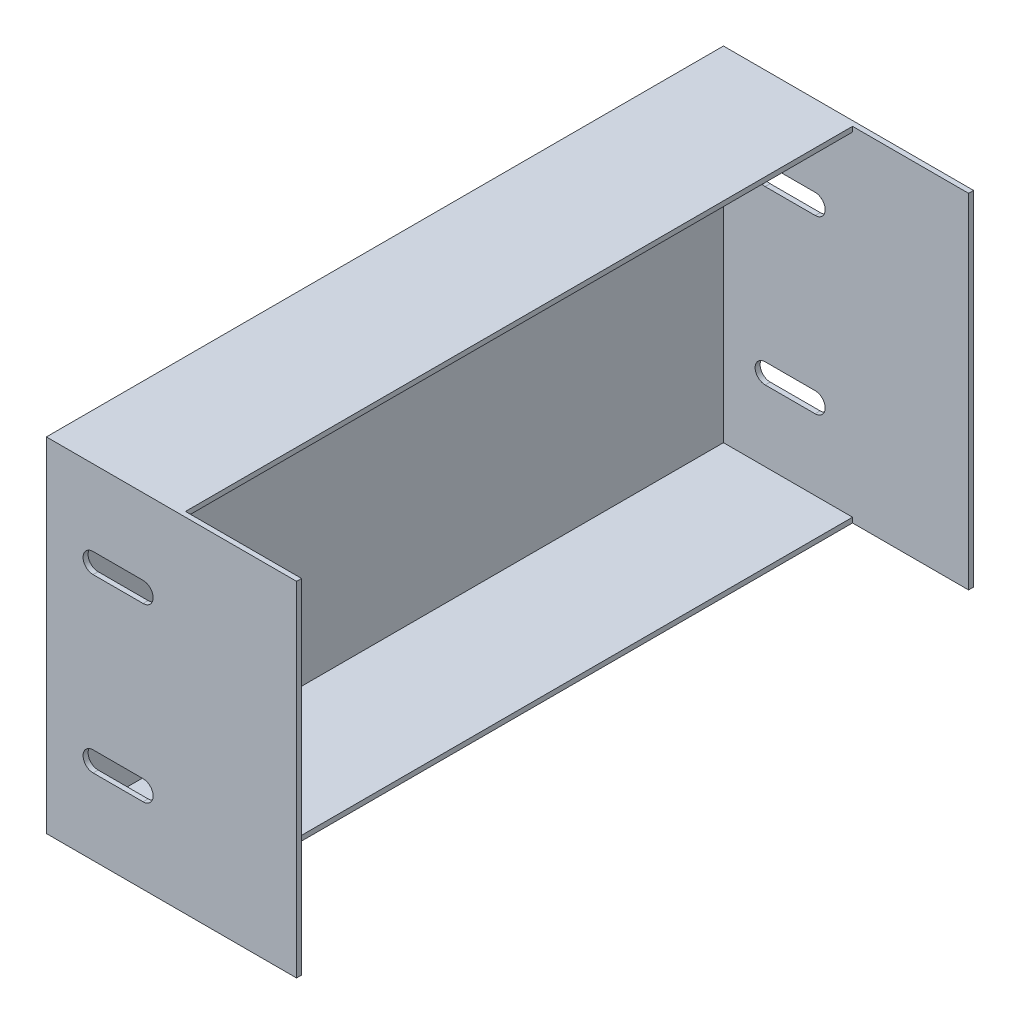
from build123d import *

# Parameters (mm, degrees)
SKETCH1_W               = 103
SKETCH1_H               = 203
SKETCH1_W_2             = 100
SKETCH1_H_2             = 200
EXTRUDE_THIN1_DEPTH     = 75
SKETCH2_W               = 203
SKETCH2_H               = 103
BOSS_EXTRUDE2_DEPTH     = 1.5
CUT_EXTRUDE1_DEPTH      = 137.306639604
CUT_EXTRUDE1_DEPTH_BACK = 137.306639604
CUT_EXTRUDE2_DEPTH      = 170.054724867
CUT_EXTRUDE2_DEPTH_BACK = 170.054724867
SKETCH4_W               = 200
SKETCH4_H               = 34.799448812


with BuildPart() as part:
    # Sketch1 → Extrude-Thin1 (new body)
    with BuildSketch(Plane(origin=(0, 0, 0), x_dir=(0, -1, 0), z_dir=(1, 0, 0))):
        Rectangle(SKETCH1_W, SKETCH1_H)
        Rectangle(SKETCH1_W_2, SKETCH1_H_2, mode=Mode.SUBTRACT)
    extrude(amount=EXTRUDE_THIN1_DEPTH)

    # Sketch2 → Boss-Extrude2 (add)
    with BuildSketch(Plane(origin=(0, 0, 0), x_dir=(0, 0, -1), z_dir=(1, 0, 0))):
        Rectangle(SKETCH2_W, SKETCH2_H)
    extrude(amount=BOSS_EXTRUDE2_DEPTH)

    # Sketch3 → Cut-Extrude1 (cut, two sides: drawn at the far end of the back side and taken through both)
    with BuildSketch(Plane.XY.offset(-CUT_EXTRUDE1_DEPTH_BACK)):
        with BuildLine():
            Line((14, 28.75), (29, 28.75))
            ThreePointArc((29, 28.75), (32, 25.75), (29, 22.75))
            Line((29, 22.75), (14, 22.75))
            ThreePointArc((14, 22.75), (11, 25.75), (14, 28.75))
        make_face()
        with BuildLine():
            Line((14, -22.75), (29, -22.75))
            ThreePointArc((29, -22.75), (32, -25.75), (29, -28.75))
            Line((29, -28.75), (14, -28.75))
            ThreePointArc((14, -28.75), (11, -25.75), (14, -22.75))
        make_face()
    extrude(amount=CUT_EXTRUDE1_DEPTH + CUT_EXTRUDE1_DEPTH_BACK, mode=Mode.SUBTRACT)

    # Sketch4 → Cut-Extrude2 (cut, two sides: drawn at the far end of the back side and taken through both)
    with BuildSketch(Plane(origin=(-50, 0, 0), x_dir=(0, 0, -1), z_dir=(0, -1, 0)).offset(-CUT_EXTRUDE2_DEPTH_BACK)):
        with Locations((0, 107.600275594)):
            Rectangle(SKETCH4_W, SKETCH4_H)
    extrude(amount=CUT_EXTRUDE2_DEPTH + CUT_EXTRUDE2_DEPTH_BACK, mode=Mode.SUBTRACT)


solid = part.part
